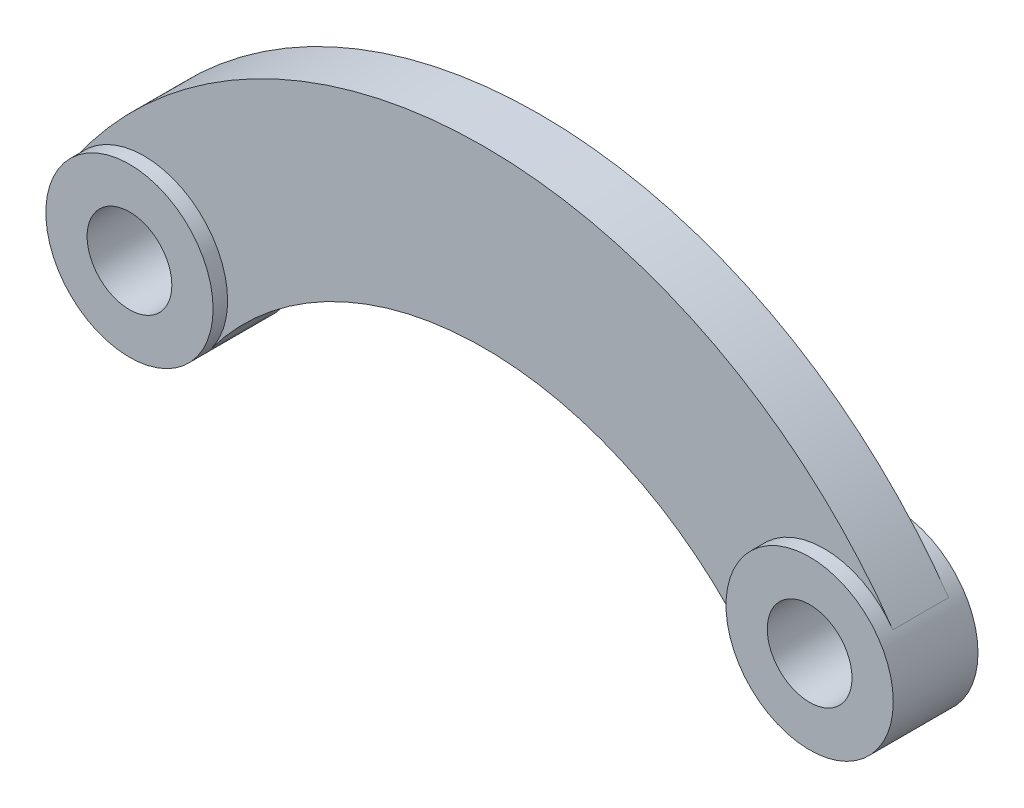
from build123d import *

# Parameters (mm, degrees)
BOSS_EXTRUDE1_DEPTH = 25
SKETCH1_3_R         = 75
BOSS_EXTRUDE2_DEPTH = 38
SKETCH2_R           = 38
CUT_EXTRUDE1_DEPTH  = 454.095245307


with BuildPart() as part:
    # Sketch1 → Boss-Extrude1 (new, symmetric)
    with BuildSketch(Plane.XY):
        with BuildLine():
            ThreePointArc((-366.657681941, 42.700471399), (-282.631787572, 71.586752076), (-230, 0))
            ThreePointArc((-230, 0), (-233.796760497, -23.560532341), (-244.802631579, -44.735632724))
            ThreePointArc((-244.802631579, -44.735632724), (0, 78.339460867), (244.802631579, -44.735632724))
            ThreePointArc((244.802631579, -44.735632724), (261.27585101, 60.936022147), (366.657681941, 42.700471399))
            ThreePointArc((366.657681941, 42.700471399), (0, 234.775001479), (-366.657681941, 42.700471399))
        make_face()
    extrude(amount=BOSS_EXTRUDE1_DEPTH, both=True)

    # Sketch1_3 → Boss-Extrude2 (add, symmetric)
    with BuildSketch(Plane.XY):
        with Locations((-305, 0)):
            Circle(SKETCH1_3_R)
        with Locations((305, 0)):
            Circle(SKETCH1_3_R)
    extrude(amount=BOSS_EXTRUDE2_DEPTH, both=True)

    # Sketch2 → Cut-Extrude1 (cut, through all)
    with BuildSketch(Plane.XY.offset(38)):
        with Locations((-305, 0)):
            Circle(SKETCH2_R)
        with Locations((305, 0)):
            Circle(SKETCH2_R)
    extrude(amount=-CUT_EXTRUDE1_DEPTH, mode=Mode.SUBTRACT)


solid = part.part
